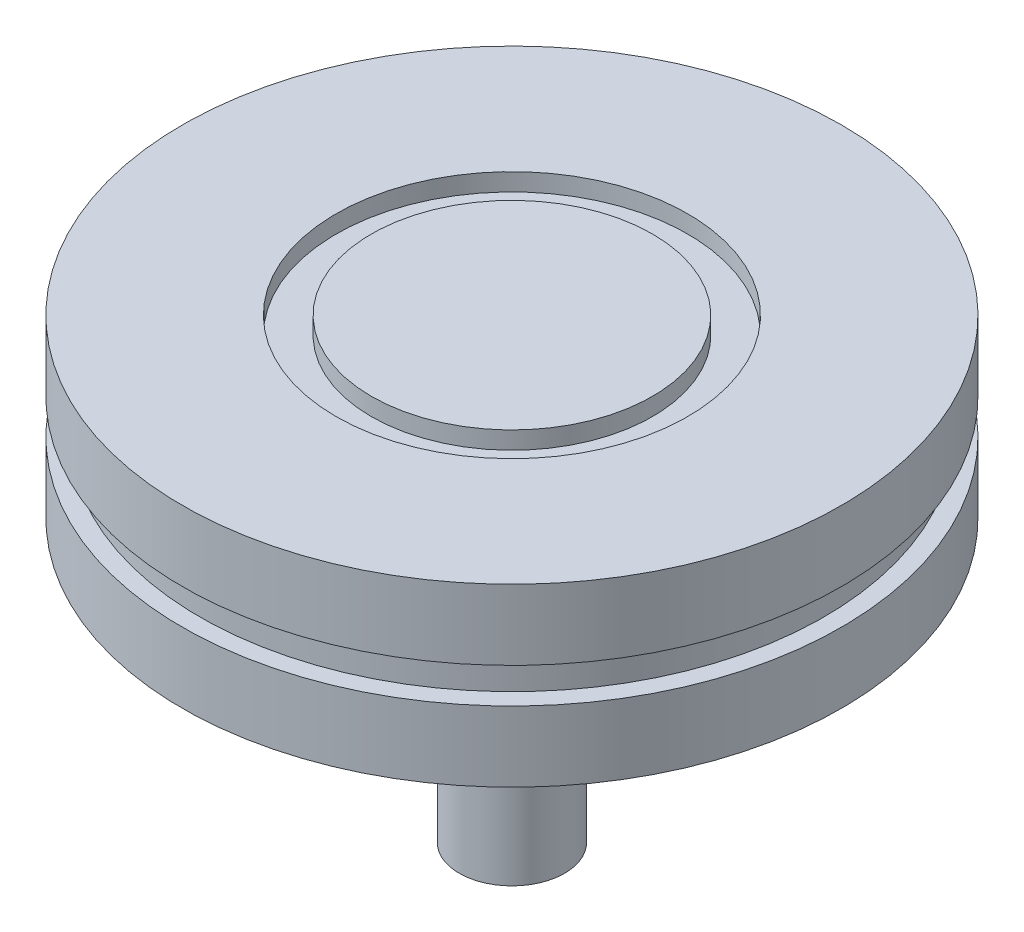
from build123d import *

# Parameters (mm, degrees)
F_10_32_TAPPED_HOLE1_D     = 4.0386
F_10_32_TAPPED_HOLE1_DEPTH = 7.62
F_10_32_TAPPED_HOLE1_TIP   = 1.213317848
SKETCH5_R                  = 12.7
SKETCH5_R_2                = 10.16
CUT_EXTRUDE1_DEPTH         = 1.27


with BuildPart() as part:
    # Sketch1 → Revolve1 (revolve)
    with BuildSketch(Plane.XY, mode=Mode.PRIVATE) as revolve1_sk:
        Polygon((0, 0), (-3.81, 0), (-3.81, 20.32), (-23.8125, 20.32), (-23.8125, 25.4), (-22.5425, 25.4), (-22.5425, 27.94), (-23.8125, 27.94), (-23.8125, 33.02), (0, 33.02), align=None)
    revolve(revolve1_sk.sketch.rotate(Axis((0, 0, 0), (0, 1, 0)), 270), axis=Axis((0, 0, 0), (0, 1, 0)))

    # 10-32 Tapped Hole1
    with Locations(Plane(origin=(0, 0, 0), x_dir=(-1, 0, 0), z_dir=(0, -1, 0))):
        with Locations((0, 0)):
            Hole(F_10_32_TAPPED_HOLE1_D / 2, depth=F_10_32_TAPPED_HOLE1_DEPTH)
            with Locations((0, 0, -(F_10_32_TAPPED_HOLE1_DEPTH + F_10_32_TAPPED_HOLE1_TIP / 2))):  # 118° drill point
                Cone(0, F_10_32_TAPPED_HOLE1_D / 2, F_10_32_TAPPED_HOLE1_TIP, mode=Mode.SUBTRACT)

    # Sketch5 → Cut-Extrude1 (cut)
    with BuildSketch(Plane(origin=(0, 33.02, 0), x_dir=(1, 0, 0), z_dir=(0, 1, 0))):
        with Locations(Location((0, 0, 0), (0, 0, 270))):
            Circle(SKETCH5_R)
        with Locations(Location((0, 0, 0), (0, 0, 270))):
            Circle(SKETCH5_R_2, mode=Mode.SUBTRACT)
    extrude(amount=-CUT_EXTRUDE1_DEPTH, mode=Mode.SUBTRACT)


solid = part.part
